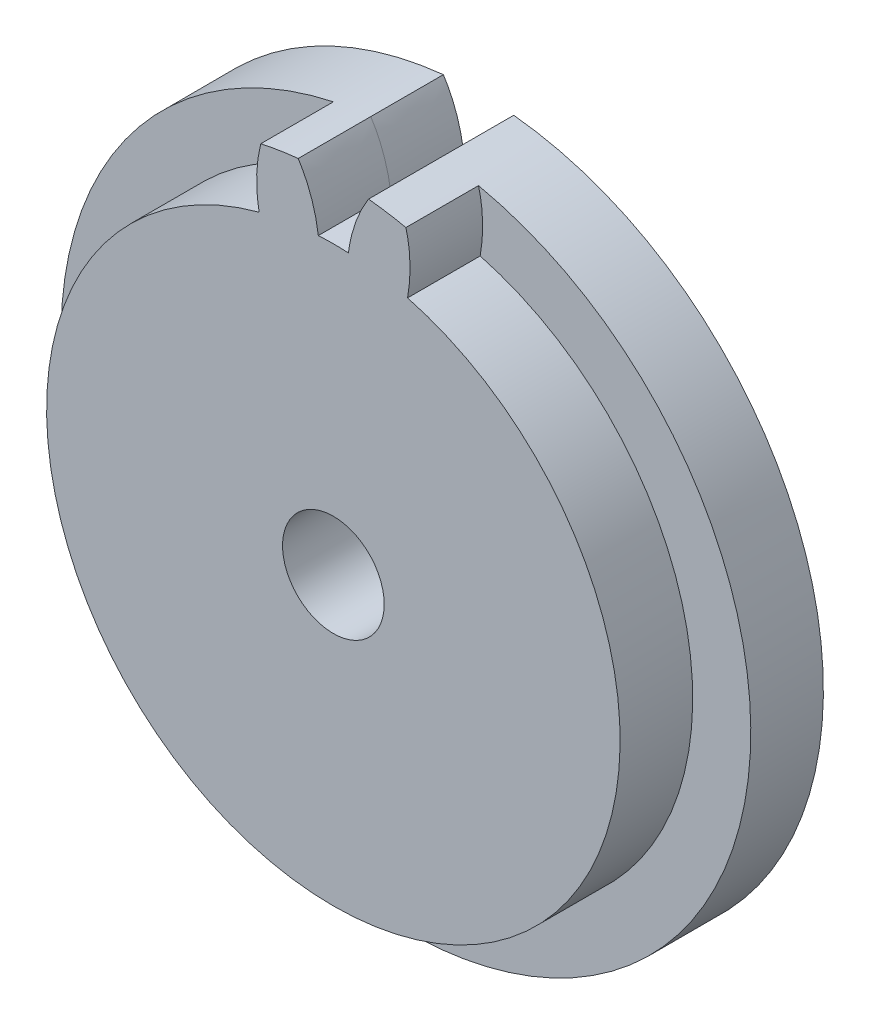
ISO-10303-21;
HEADER;
FILE_DESCRIPTION(('STEP AP214'),'2;1');
FILE_NAME('part.step','',(''),(''),'','','');
FILE_SCHEMA(('AUTOMOTIVE_DESIGN { 1 0 10303 214 1 1 1 1 }'));
ENDSEC;
DATA;
#1=APPLICATION_CONTEXT('core data for automotive mechanical design processes');
#2=APPLICATION_PROTOCOL_DEFINITION('international standard','automotive_design',2000,#1);
#3=PRODUCT_CONTEXT('',#1,'mechanical');
#4=PRODUCT('Part','Part','',(#3));
#5=PRODUCT_RELATED_PRODUCT_CATEGORY('part','',(#4));
#6=PRODUCT_DEFINITION_FORMATION('','',#4);
#7=PRODUCT_DEFINITION_CONTEXT('part definition',#1,'design');
#8=PRODUCT_DEFINITION('design','',#6,#7);
#9=PRODUCT_DEFINITION_SHAPE('','',#8);
#10=(LENGTH_UNIT() NAMED_UNIT(*) SI_UNIT(.MILLI.,.METRE.));
#11=(NAMED_UNIT(*) PLANE_ANGLE_UNIT() SI_UNIT($,.RADIAN.));
#12=(NAMED_UNIT(*) SI_UNIT($,.STERADIAN.) SOLID_ANGLE_UNIT());
#13=UNCERTAINTY_MEASURE_WITH_UNIT(LENGTH_MEASURE(1.E-05),#10,'distance_accuracy_value','');
#14=(GEOMETRIC_REPRESENTATION_CONTEXT(3) GLOBAL_UNCERTAINTY_ASSIGNED_CONTEXT((#13)) GLOBAL_UNIT_ASSIGNED_CONTEXT((#10,
#11,#12)) REPRESENTATION_CONTEXT('',''));
#15=CARTESIAN_POINT('',(0.,0.,0.));
#16=DIRECTION('',(0.,0.,1.));
#17=DIRECTION('',(1.,0.,0.));
#18=AXIS2_PLACEMENT_3D('',#15,#16,#17);
#19=CARTESIAN_POINT('',(4.82274820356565,47.2191729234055,10.));
#20=DIRECTION('',(0.,0.,1.));
#21=DIRECTION('',(1.,0.,0.));
#22=AXIS2_PLACEMENT_3D('',#19,#20,#21);
#23=PLANE('',#22);
#24=CARTESIAN_POINT('',(0.,0.,10.));
#25=DIRECTION('',(0.,0.,1.));
#26=DIRECTION('',(1.,0.,0.));
#27=AXIS2_PLACEMENT_3D('',#24,#25,#26);
#28=CIRCLE('',#27,7.);
#29=CARTESIAN_POINT('',(7.,0.,10.));
#30=VERTEX_POINT('',#29);
#31=EDGE_CURVE('E182',#30,#30,#28,.T.);
#32=ORIENTED_EDGE('',*,*,#31,.F.);
#33=EDGE_LOOP('',(#32));
#34=FACE_BOUND('',#33,.T.);
#35=CARTESIAN_POINT('',(-966825.615684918,-255421.5139562,10.));
#36=CARTESIAN_POINT('',(968322.511542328,249788.043572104,10.));
#37=CARTESIAN_POINT('',(-969779.388116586,-243968.979534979,10.));
#38=B_SPLINE_CURVE_WITH_KNOTS('',2,(#35,#36,#37),.UNSPECIFIED.,.F.,.F.,(3,3),(0.,1.),.UNSPECIFIED.);
#39=CARTESIAN_POINT('',(10.2233522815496,38.1540701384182,10.));
#40=VERTEX_POINT('',#39);
#41=CARTESIAN_POINT('',(9.99494482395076,46.436527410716,10.));
#42=VERTEX_POINT('',#41);
#43=EDGE_CURVE('E167',#40,#42,#38,.T.);
#44=ORIENTED_EDGE('',*,*,#43,.T.);
#45=CARTESIAN_POINT('',(0.,0.,10.));
#46=DIRECTION('',(0.,0.,1.));
#47=DIRECTION('',(1.,0.,0.));
#48=AXIS2_PLACEMENT_3D('',#45,#46,#47);
#49=CIRCLE('',#48,47.5);
#50=CARTESIAN_POINT('',(4.84391872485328,47.2523697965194,10.));
#51=VERTEX_POINT('',#50);
#52=EDGE_CURVE('E293',#42,#51,#49,.T.);
#53=ORIENTED_EDGE('',*,*,#52,.T.);
#54=CARTESIAN_POINT('',(846924.445660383,-531706.599483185,10.));
#55=CARTESIAN_POINT('',(-843740.68402217,536790.658634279,10.));
#56=CARTESIAN_POINT('',(840576.213376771,-541685.841093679,10.));
#57=B_SPLINE_CURVE_WITH_KNOTS('',2,(#54,#55,#56),.UNSPECIFIED.,.F.,.F.,(3,3),(0.,1.),.UNSPECIFIED.);
#58=CARTESIAN_POINT('',(2.06727027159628,39.4458666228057,10.));
#59=VERTEX_POINT('',#58);
#60=EDGE_CURVE('E208',#51,#59,#57,.T.);
#61=ORIENTED_EDGE('',*,*,#60,.T.);
#62=CARTESIAN_POINT('',(0.,0.,10.));
#63=DIRECTION('',(0.,0.,1.));
#64=DIRECTION('',(1.,0.,0.));
#65=AXIS2_PLACEMENT_3D('',#62,#63,#64);
#66=CIRCLE('',#65,39.5);
#67=CARTESIAN_POINT('',(-2.06727027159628,39.4458666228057,10.));
#68=VERTEX_POINT('',#67);
#69=EDGE_CURVE('E226',#59,#68,#66,.T.);
#70=ORIENTED_EDGE('',*,*,#69,.T.);
#71=CARTESIAN_POINT('',(-840576.213376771,-541685.841093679,10.));
#72=CARTESIAN_POINT('',(843740.68402217,536790.658634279,10.));
#73=CARTESIAN_POINT('',(-846924.445660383,-531706.599483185,10.));
#74=B_SPLINE_CURVE_WITH_KNOTS('',2,(#71,#72,#73),.UNSPECIFIED.,.F.,.F.,(3,3),(0.,1.),.UNSPECIFIED.);
#75=CARTESIAN_POINT('',(-4.84391872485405,47.2523697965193,10.));
#76=VERTEX_POINT('',#75);
#77=EDGE_CURVE('E242',#68,#76,#74,.T.);
#78=ORIENTED_EDGE('',*,*,#77,.T.);
#79=CARTESIAN_POINT('',(-9.99494482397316,46.4365274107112,10.));
#80=VERTEX_POINT('',#79);
#81=EDGE_CURVE('E295',#76,#80,#49,.T.);
#82=ORIENTED_EDGE('',*,*,#81,.T.);
#83=CARTESIAN_POINT('',(969779.388116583,-243968.979534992,10.));
#84=CARTESIAN_POINT('',(-968322.511542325,249788.043572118,10.));
#85=CARTESIAN_POINT('',(966825.615684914,-255421.513956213,10.));
#86=B_SPLINE_CURVE_WITH_KNOTS('',2,(#83,#84,#85),.UNSPECIFIED.,.F.,.F.,(3,3),(0.,1.),.UNSPECIFIED.);
#87=CARTESIAN_POINT('',(-10.2233522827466,38.1540701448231,10.));
#88=VERTEX_POINT('',#87);
#89=EDGE_CURVE('E247',#80,#88,#86,.T.);
#90=ORIENTED_EDGE('',*,*,#89,.T.);
#91=CARTESIAN_POINT('',(0.,0.,10.));
#92=DIRECTION('',(0.,0.,1.));
#93=DIRECTION('',(1.,0.,0.));
#94=AXIS2_PLACEMENT_3D('',#91,#92,#93);
#95=CIRCLE('',#94,39.5);
#96=EDGE_CURVE('E56',#88,#40,#95,.T.);
#97=ORIENTED_EDGE('',*,*,#96,.T.);
#98=EDGE_LOOP('',(#44,#53,#61,#70,#78,#82,#90,#97));
#99=FACE_BOUND('',#98,.T.);
#100=ADVANCED_FACE('F33',(#34,#99),#23,.T.);
#101=DIRECTION('',(0.,0.,-1.));
#102=VECTOR('',#101,1.);
#103=SURFACE_OF_LINEAR_EXTRUSION('',#57,#102);
#104=DIRECTION('',(0.,0.,-1.));
#105=VECTOR('',#104,1.);
#106=CARTESIAN_POINT('',(4.84391872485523,47.2523697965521,10.));
#107=LINE('',#106,#105);
#108=CARTESIAN_POINT('',(4.84391872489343,47.2523697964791,0.));
#109=VERTEX_POINT('',#108);
#110=EDGE_CURVE('E123',#109,#51,#107,.F.);
#111=ORIENTED_EDGE('',*,*,#110,.F.);
#112=CARTESIAN_POINT('',(846924.445660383,-531706.599483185,0.));
#113=CARTESIAN_POINT('',(-843740.68402217,536790.658634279,0.));
#114=CARTESIAN_POINT('',(840576.213376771,-541685.841093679,0.));
#115=B_SPLINE_CURVE_WITH_KNOTS('',2,(#112,#113,#114),.UNSPECIFIED.,.F.,.F.,(3,3),(0.,1.),.UNSPECIFIED.);
#116=CARTESIAN_POINT('',(2.06727027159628,39.4458666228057,0.));
#117=VERTEX_POINT('',#116);
#118=EDGE_CURVE('E122',#109,#117,#115,.T.);
#119=ORIENTED_EDGE('',*,*,#118,.T.);
#120=DIRECTION('',(0.,0.,-1.));
#121=VECTOR('',#120,1.);
#122=CARTESIAN_POINT('',(2.06727027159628,39.4458666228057,10.));
#123=LINE('',#122,#121);
#124=EDGE_CURVE('E42',#59,#117,#123,.T.);
#125=ORIENTED_EDGE('',*,*,#124,.F.);
#126=ORIENTED_EDGE('',*,*,#60,.F.);
#127=EDGE_LOOP('',(#111,#119,#125,#126));
#128=FACE_BOUND('',#127,.T.);
#129=ADVANCED_FACE('F35',(#128),#103,.F.);
#130=DIRECTION('',(0.,0.,-1.));
#131=VECTOR('',#130,1.);
#132=SURFACE_OF_LINEAR_EXTRUSION('',#74,#131);
#133=DIRECTION('',(0.,0.,-1.));
#134=VECTOR('',#133,1.);
#135=CARTESIAN_POINT('',(-4.84391872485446,47.2523697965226,10.));
#136=LINE('',#135,#134);
#137=CARTESIAN_POINT('',(-4.84391872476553,47.2523697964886,0.));
#138=VERTEX_POINT('',#137);
#139=EDGE_CURVE('E124',#76,#138,#136,.T.);
#140=ORIENTED_EDGE('',*,*,#139,.F.);
#141=ORIENTED_EDGE('',*,*,#77,.F.);
#142=DIRECTION('',(0.,0.,-1.));
#143=VECTOR('',#142,1.);
#144=CARTESIAN_POINT('',(-2.06727027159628,39.4458666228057,10.));
#145=LINE('',#144,#143);
#146=CARTESIAN_POINT('',(-2.06727027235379,39.4458666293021,0.));
#147=VERTEX_POINT('',#146);
#148=EDGE_CURVE('E217',#68,#147,#145,.T.);
#149=ORIENTED_EDGE('',*,*,#148,.T.);
#150=CARTESIAN_POINT('',(-840576.213376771,-541685.841093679,0.));
#151=CARTESIAN_POINT('',(843740.68402217,536790.658634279,0.));
#152=CARTESIAN_POINT('',(-846924.445660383,-531706.599483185,0.));
#153=B_SPLINE_CURVE_WITH_KNOTS('',2,(#150,#151,#152),.UNSPECIFIED.,.F.,.F.,(3,3),(0.,1.),.UNSPECIFIED.);
#154=EDGE_CURVE('E181',#147,#138,#153,.T.);
#155=ORIENTED_EDGE('',*,*,#154,.T.);
#156=EDGE_LOOP('',(#140,#141,#149,#155));
#157=FACE_BOUND('',#156,.T.);
#158=ADVANCED_FACE('F255',(#157),#132,.F.);
#159=DIRECTION('',(0.,0.,-1.));
#160=VECTOR('',#159,1.);
#161=SURFACE_OF_LINEAR_EXTRUSION('',#86,#160);
#162=DIRECTION('',(0.,0.,-1.));
#163=VECTOR('',#162,1.);
#164=CARTESIAN_POINT('',(-9.9949448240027,46.4365274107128,10.));
#165=LINE('',#164,#163);
#166=CARTESIAN_POINT('',(-9.99494482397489,46.4365274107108,0.));
#167=VERTEX_POINT('',#166);
#168=EDGE_CURVE('E135',#167,#80,#165,.F.);
#169=ORIENTED_EDGE('',*,*,#168,.F.);
#170=CARTESIAN_POINT('',(969779.388116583,-243968.979534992,0.));
#171=CARTESIAN_POINT('',(-968322.511542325,249788.043572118,0.));
#172=CARTESIAN_POINT('',(966825.615684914,-255421.513956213,0.));
#173=B_SPLINE_CURVE_WITH_KNOTS('',2,(#170,#171,#172),.UNSPECIFIED.,.F.,.F.,(3,3),(0.,1.),.UNSPECIFIED.);
#174=CARTESIAN_POINT('',(-10.2233522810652,38.154070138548,0.));
#175=VERTEX_POINT('',#174);
#176=EDGE_CURVE('E190',#167,#175,#173,.T.);
#177=ORIENTED_EDGE('',*,*,#176,.T.);
#178=DIRECTION('',(0.,0.,-1.));
#179=VECTOR('',#178,1.);
#180=CARTESIAN_POINT('',(-10.2233522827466,38.1540701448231,10.));
#181=LINE('',#180,#179);
#182=EDGE_CURVE('E214',#88,#175,#181,.T.);
#183=ORIENTED_EDGE('',*,*,#182,.F.);
#184=ORIENTED_EDGE('',*,*,#89,.F.);
#185=EDGE_LOOP('',(#169,#177,#183,#184));
#186=FACE_BOUND('',#185,.T.);
#187=ADVANCED_FACE('F164',(#186),#161,.F.);
#188=DIRECTION('',(0.,0.,-1.));
#189=VECTOR('',#188,1.);
#190=SURFACE_OF_LINEAR_EXTRUSION('',#38,#189);
#191=DIRECTION('',(0.,0.,-1.));
#192=VECTOR('',#191,1.);
#193=CARTESIAN_POINT('',(9.99494482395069,46.4365274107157,10.));
#194=LINE('',#193,#192);
#195=CARTESIAN_POINT('',(9.994944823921,46.4365274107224,0.));
#196=VERTEX_POINT('',#195);
#197=EDGE_CURVE('E280',#42,#196,#194,.T.);
#198=ORIENTED_EDGE('',*,*,#197,.F.);
#199=ORIENTED_EDGE('',*,*,#43,.F.);
#200=DIRECTION('',(0.,0.,-1.));
#201=VECTOR('',#200,1.);
#202=CARTESIAN_POINT('',(10.2233522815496,38.1540701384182,10.));
#203=LINE('',#202,#201);
#204=CARTESIAN_POINT('',(10.2233522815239,38.1540701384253,0.));
#205=VERTEX_POINT('',#204);
#206=EDGE_CURVE('E173',#40,#205,#203,.T.);
#207=ORIENTED_EDGE('',*,*,#206,.T.);
#208=CARTESIAN_POINT('',(-966825.615684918,-255421.5139562,0.));
#209=CARTESIAN_POINT('',(968322.511542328,249788.043572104,0.));
#210=CARTESIAN_POINT('',(-969779.388116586,-243968.979534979,0.));
#211=B_SPLINE_CURVE_WITH_KNOTS('',2,(#208,#209,#210),.UNSPECIFIED.,.F.,.F.,(3,3),(0.,1.),.UNSPECIFIED.);
#212=EDGE_CURVE('E203',#205,#196,#211,.T.);
#213=ORIENTED_EDGE('',*,*,#212,.T.);
#214=EDGE_LOOP('',(#198,#199,#207,#213));
#215=FACE_BOUND('',#214,.T.);
#216=ADVANCED_FACE('F160',(#215),#190,.F.);
#217=CARTESIAN_POINT('',(4.82274820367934,47.2191729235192,0.));
#218=DIRECTION('',(0.,0.,-1.));
#219=DIRECTION('',(-1.,0.,0.));
#220=AXIS2_PLACEMENT_3D('',#217,#218,#219);
#221=PLANE('',#220);
#222=CARTESIAN_POINT('',(0.,0.,0.));
#223=DIRECTION('',(0.,0.,-1.));
#224=DIRECTION('',(-1.,0.,0.));
#225=AXIS2_PLACEMENT_3D('',#222,#223,#224);
#226=CIRCLE('',#225,47.5);
#227=EDGE_CURVE('E277',#196,#167,#226,.T.);
#228=ORIENTED_EDGE('',*,*,#227,.F.);
#229=ORIENTED_EDGE('',*,*,#212,.F.);
#230=CARTESIAN_POINT('',(0.,0.,0.));
#231=DIRECTION('',(0.,0.,1.));
#232=DIRECTION('',(1.,0.,0.));
#233=AXIS2_PLACEMENT_3D('',#230,#231,#232);
#234=CIRCLE('',#233,39.5);
#235=EDGE_CURVE('E197',#175,#205,#234,.T.);
#236=ORIENTED_EDGE('',*,*,#235,.F.);
#237=ORIENTED_EDGE('',*,*,#176,.F.);
#238=EDGE_LOOP('',(#228,#229,#236,#237));
#239=FACE_BOUND('',#238,.T.);
#240=ADVANCED_FACE('F150',(#239),#221,.F.);
#241=CARTESIAN_POINT('',(846924.445660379,-531706.599483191,-10.));
#242=CARTESIAN_POINT('',(-843740.68402217,536790.658634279,-10.));
#243=CARTESIAN_POINT('',(840576.213376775,-541685.841093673,-10.));
#244=B_SPLINE_CURVE_WITH_KNOTS('',2,(#241,#242,#243),.UNSPECIFIED.,.F.,.F.,(3,3),(0.,1.),.UNSPECIFIED.);
#245=DIRECTION('',(0.,0.,1.));
#246=VECTOR('',#245,1.);
#247=SURFACE_OF_LINEAR_EXTRUSION('',#244,#246);
#248=ORIENTED_EDGE('',*,*,#118,.F.);
#249=DIRECTION('',(0.,0.,1.));
#250=VECTOR('',#249,1.);
#251=CARTESIAN_POINT('',(4.84391872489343,47.2523697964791,-10.));
#252=LINE('',#251,#250);
#253=CARTESIAN_POINT('',(4.84391872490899,47.2523697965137,-10.));
#254=VERTEX_POINT('',#253);
#255=EDGE_CURVE('E110',#109,#254,#252,.F.);
#256=ORIENTED_EDGE('',*,*,#255,.T.);
#257=CARTESIAN_POINT('',(2.06727027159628,39.4458666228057,-10.));
#258=VERTEX_POINT('',#257);
#259=EDGE_CURVE('E120',#254,#258,#244,.T.);
#260=ORIENTED_EDGE('',*,*,#259,.T.);
#261=DIRECTION('',(0.,0.,1.));
#262=VECTOR('',#261,1.);
#263=CARTESIAN_POINT('',(2.06727027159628,39.4458666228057,-10.));
#264=LINE('',#263,#262);
#265=EDGE_CURVE('E224',#258,#117,#264,.T.);
#266=ORIENTED_EDGE('',*,*,#265,.T.);
#267=EDGE_LOOP('',(#248,#256,#260,#266));
#268=FACE_BOUND('',#267,.T.);
#269=ADVANCED_FACE('F118',(#268),#247,.T.);
#270=CARTESIAN_POINT('',(-840576.213376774,-541685.841093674,-10.));
#271=CARTESIAN_POINT('',(843740.684022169,536790.65863428,-10.));
#272=CARTESIAN_POINT('',(-846924.445660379,-531706.599483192,-10.));
#273=B_SPLINE_CURVE_WITH_KNOTS('',2,(#270,#271,#272),.UNSPECIFIED.,.F.,.F.,(3,3),(0.,1.),.UNSPECIFIED.);
#274=DIRECTION('',(0.,0.,1.));
#275=VECTOR('',#274,1.);
#276=SURFACE_OF_LINEAR_EXTRUSION('',#273,#275);
#277=CARTESIAN_POINT('',(-2.06727027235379,39.4458666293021,-10.));
#278=VERTEX_POINT('',#277);
#279=CARTESIAN_POINT('',(-4.84391872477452,47.2523697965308,-10.));
#280=VERTEX_POINT('',#279);
#281=EDGE_CURVE('E132',#278,#280,#273,.T.);
#282=ORIENTED_EDGE('',*,*,#281,.T.);
#283=DIRECTION('',(0.,0.,1.));
#284=VECTOR('',#283,1.);
#285=CARTESIAN_POINT('',(-4.84391872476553,47.2523697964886,-10.));
#286=LINE('',#285,#284);
#287=EDGE_CURVE('E49',#280,#138,#286,.T.);
#288=ORIENTED_EDGE('',*,*,#287,.T.);
#289=ORIENTED_EDGE('',*,*,#154,.F.);
#290=DIRECTION('',(0.,0.,1.));
#291=VECTOR('',#290,1.);
#292=CARTESIAN_POINT('',(-2.06727027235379,39.4458666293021,-10.));
#293=LINE('',#292,#291);
#294=EDGE_CURVE('E229',#278,#147,#293,.T.);
#295=ORIENTED_EDGE('',*,*,#294,.F.);
#296=EDGE_LOOP('',(#282,#288,#289,#295));
#297=FACE_BOUND('',#296,.T.);
#298=ADVANCED_FACE('F149',(#297),#276,.T.);
#299=CARTESIAN_POINT('',(4.82274820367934,47.2191729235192,-10.));
#300=DIRECTION('',(0.,0.,-1.));
#301=DIRECTION('',(-1.,0.,0.));
#302=AXIS2_PLACEMENT_3D('',#299,#300,#301);
#303=PLANE('',#302);
#304=CARTESIAN_POINT('',(0.,0.,-10.));
#305=DIRECTION('',(0.,0.,1.));
#306=DIRECTION('',(1.,0.,0.));
#307=AXIS2_PLACEMENT_3D('',#304,#305,#306);
#308=CIRCLE('',#307,7.);
#309=CARTESIAN_POINT('',(7.,0.,-10.));
#310=VERTEX_POINT('',#309);
#311=EDGE_CURVE('E130',#310,#310,#308,.T.);
#312=ORIENTED_EDGE('',*,*,#311,.T.);
#313=EDGE_LOOP('',(#312));
#314=FACE_BOUND('',#313,.T.);
#315=ORIENTED_EDGE('',*,*,#259,.F.);
#316=CARTESIAN_POINT('',(0.,0.,-10.));
#317=DIRECTION('',(0.,0.,-1.));
#318=DIRECTION('',(-1.,0.,0.));
#319=AXIS2_PLACEMENT_3D('',#316,#317,#318);
#320=CIRCLE('',#319,47.5);
#321=EDGE_CURVE('E11',#254,#280,#320,.T.);
#322=ORIENTED_EDGE('',*,*,#321,.T.);
#323=ORIENTED_EDGE('',*,*,#281,.F.);
#324=CARTESIAN_POINT('',(0.,0.,-10.));
#325=DIRECTION('',(0.,0.,1.));
#326=DIRECTION('',(1.,0.,0.));
#327=AXIS2_PLACEMENT_3D('',#324,#325,#326);
#328=CIRCLE('',#327,39.5);
#329=EDGE_CURVE('E129',#258,#278,#328,.T.);
#330=ORIENTED_EDGE('',*,*,#329,.F.);
#331=EDGE_LOOP('',(#315,#322,#323,#330));
#332=FACE_BOUND('',#331,.T.);
#333=ADVANCED_FACE('F127',(#314,#332),#303,.T.);
#334=CARTESIAN_POINT('',(0.,0.,10.));
#335=DIRECTION('',(0.,0.,-1.));
#336=DIRECTION('',(-1.,0.,0.));
#337=AXIS2_PLACEMENT_3D('',#334,#335,#336);
#338=CYLINDRICAL_SURFACE('',#337,39.5);
#339=ORIENTED_EDGE('',*,*,#124,.T.);
#340=ORIENTED_EDGE('',*,*,#265,.F.);
#341=ORIENTED_EDGE('',*,*,#329,.T.);
#342=ORIENTED_EDGE('',*,*,#294,.T.);
#343=ORIENTED_EDGE('',*,*,#148,.F.);
#344=ORIENTED_EDGE('',*,*,#69,.F.);
#345=EDGE_LOOP('',(#339,#340,#341,#342,#343,#344));
#346=FACE_BOUND('',#345,.T.);
#347=ADVANCED_FACE('F223',(#346),#338,.T.);
#348=CARTESIAN_POINT('',(0.,0.,10.));
#349=DIRECTION('',(0.,0.,-1.));
#350=DIRECTION('',(-1.,0.,0.));
#351=AXIS2_PLACEMENT_3D('',#348,#349,#350);
#352=CYLINDRICAL_SURFACE('',#351,39.5);
#353=ORIENTED_EDGE('',*,*,#235,.T.);
#354=ORIENTED_EDGE('',*,*,#206,.F.);
#355=ORIENTED_EDGE('',*,*,#96,.F.);
#356=ORIENTED_EDGE('',*,*,#182,.T.);
#357=EDGE_LOOP('',(#353,#354,#355,#356));
#358=FACE_BOUND('',#357,.T.);
#359=ADVANCED_FACE('F155',(#358),#352,.T.);
#360=CARTESIAN_POINT('',(0.,0.,10.));
#361=DIRECTION('',(0.,0.,-1.));
#362=DIRECTION('',(-1.,0.,0.));
#363=AXIS2_PLACEMENT_3D('',#360,#361,#362);
#364=CYLINDRICAL_SURFACE('',#363,7.);
#365=ORIENTED_EDGE('',*,*,#31,.T.);
#366=EDGE_LOOP('',(#365));
#367=FACE_BOUND('',#366,.T.);
#368=ORIENTED_EDGE('',*,*,#311,.F.);
#369=EDGE_LOOP('',(#368));
#370=FACE_BOUND('',#369,.T.);
#371=ADVANCED_FACE('F152',(#367,#370),#364,.F.);
#372=CARTESIAN_POINT('',(0.,0.,-10.));
#373=DIRECTION('',(0.,0.,1.));
#374=DIRECTION('',(1.,0.,0.));
#375=AXIS2_PLACEMENT_3D('',#372,#373,#374);
#376=CYLINDRICAL_SURFACE('',#375,47.5);
#377=ORIENTED_EDGE('',*,*,#168,.T.);
#378=ORIENTED_EDGE('',*,*,#81,.F.);
#379=ORIENTED_EDGE('',*,*,#139,.T.);
#380=ORIENTED_EDGE('',*,*,#287,.F.);
#381=ORIENTED_EDGE('',*,*,#321,.F.);
#382=ORIENTED_EDGE('',*,*,#255,.F.);
#383=ORIENTED_EDGE('',*,*,#110,.T.);
#384=ORIENTED_EDGE('',*,*,#52,.F.);
#385=ORIENTED_EDGE('',*,*,#197,.T.);
#386=ORIENTED_EDGE('',*,*,#227,.T.);
#387=EDGE_LOOP('',(#377,#378,#379,#380,#381,#382,#383,#384,#385,#386));
#388=FACE_BOUND('',#387,.T.);
#389=ADVANCED_FACE('F109',(#388),#376,.T.);
#390=CLOSED_SHELL('',(#100,#129,#158,#187,#216,#240,#269,#298,#333,#347,#359,#371,#389));
#391=MANIFOLD_SOLID_BREP('B2',#390);
#392=ADVANCED_BREP_SHAPE_REPRESENTATION('',(#18,#391),#14);
#393=SHAPE_DEFINITION_REPRESENTATION(#9,#392);
ENDSEC;
END-ISO-10303-21;
